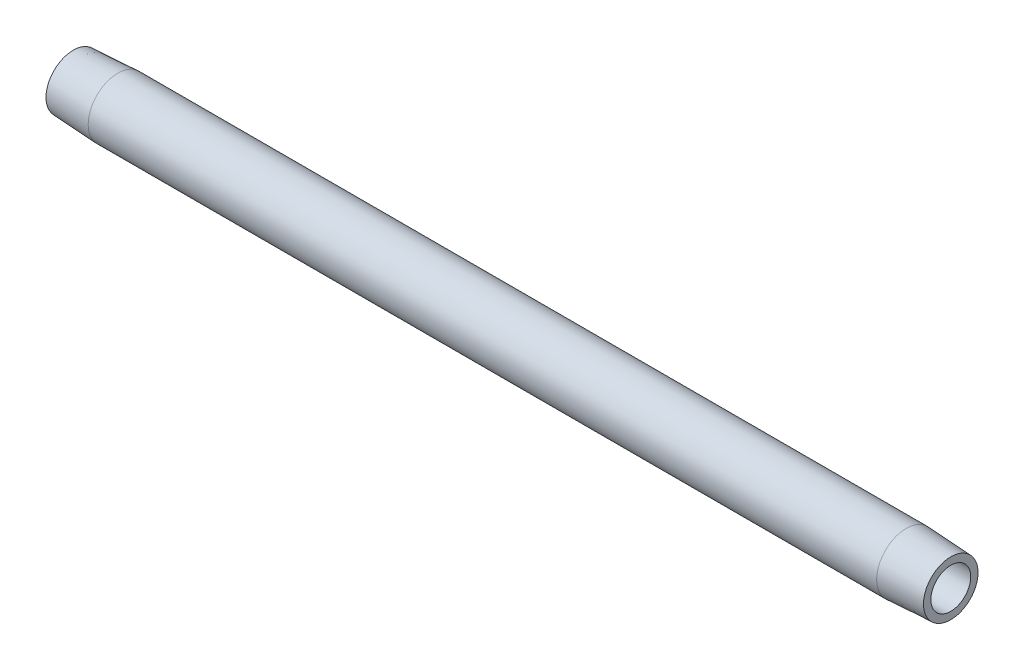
ISO-10303-21;
HEADER;
FILE_DESCRIPTION(('STEP AP214'),'2;1');
FILE_NAME('part.step','',(''),(''),'','','');
FILE_SCHEMA(('AUTOMOTIVE_DESIGN { 1 0 10303 214 1 1 1 1 }'));
ENDSEC;
DATA;
#1=APPLICATION_CONTEXT('core data for automotive mechanical design processes');
#2=APPLICATION_PROTOCOL_DEFINITION('international standard','automotive_design',2000,#1);
#3=PRODUCT_CONTEXT('',#1,'mechanical');
#4=PRODUCT('Part','Part','',(#3));
#5=PRODUCT_RELATED_PRODUCT_CATEGORY('part','',(#4));
#6=PRODUCT_DEFINITION_FORMATION('','',#4);
#7=PRODUCT_DEFINITION_CONTEXT('part definition',#1,'design');
#8=PRODUCT_DEFINITION('design','',#6,#7);
#9=PRODUCT_DEFINITION_SHAPE('','',#8);
#10=(LENGTH_UNIT() NAMED_UNIT(*) SI_UNIT(.MILLI.,.METRE.));
#11=(NAMED_UNIT(*) PLANE_ANGLE_UNIT() SI_UNIT($,.RADIAN.));
#12=(NAMED_UNIT(*) SI_UNIT($,.STERADIAN.) SOLID_ANGLE_UNIT());
#13=UNCERTAINTY_MEASURE_WITH_UNIT(LENGTH_MEASURE(1.E-05),#10,'distance_accuracy_value','');
#14=(GEOMETRIC_REPRESENTATION_CONTEXT(3) GLOBAL_UNCERTAINTY_ASSIGNED_CONTEXT((#13)) GLOBAL_UNIT_ASSIGNED_CONTEXT((#10,
#11,#12)) REPRESENTATION_CONTEXT('',''));
#15=CARTESIAN_POINT('',(0.,0.,0.));
#16=DIRECTION('',(0.,0.,1.));
#17=DIRECTION('',(1.,0.,0.));
#18=AXIS2_PLACEMENT_3D('',#15,#16,#17);
#19=CARTESIAN_POINT('',(203.2,0.,-4.62277681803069));
#20=DIRECTION('',(-1.,0.,0.));
#21=DIRECTION('',(0.,0.,1.));
#22=AXIS2_PLACEMENT_3D('',#19,#20,#21);
#23=PLANE('',#22);
#24=CARTESIAN_POINT('',(203.2,0.,0.));
#25=DIRECTION('',(-1.,0.,0.));
#26=DIRECTION('',(0.,0.,1.));
#27=AXIS2_PLACEMENT_3D('',#24,#25,#26);
#28=CIRCLE('',#27,6.31752683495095);
#29=CARTESIAN_POINT('',(203.2,0.,6.31752683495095));
#30=VERTEX_POINT('',#29);
#31=EDGE_CURVE('E10',#30,#30,#28,.T.);
#32=ORIENTED_EDGE('',*,*,#31,.F.);
#33=EDGE_LOOP('',(#32));
#34=FACE_BOUND('',#33,.T.);
#35=CARTESIAN_POINT('',(203.2,0.,0.));
#36=DIRECTION('',(-1.,0.,0.));
#37=DIRECTION('',(0.,0.,1.));
#38=AXIS2_PLACEMENT_3D('',#35,#36,#37);
#39=CIRCLE('',#38,4.62277681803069);
#40=CARTESIAN_POINT('',(203.2,0.,4.62277681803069));
#41=VERTEX_POINT('',#40);
#42=EDGE_CURVE('E52',#41,#41,#39,.T.);
#43=ORIENTED_EDGE('',*,*,#42,.T.);
#44=EDGE_LOOP('',(#43));
#45=FACE_BOUND('',#44,.T.);
#46=ADVANCED_FACE('F30',(#34,#45),#23,.F.);
#47=CARTESIAN_POINT('',(203.2,0.,0.));
#48=DIRECTION('',(-1.,0.,0.));
#49=DIRECTION('',(0.,0.,1.));
#50=AXIS2_PLACEMENT_3D('',#47,#48,#49);
#51=CONICAL_SURFACE('',#50,6.31752683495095,0.052359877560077);
#52=CARTESIAN_POINT('',(192.887600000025,0.,0.));
#53=DIRECTION('',(-1.,0.,0.));
#54=DIRECTION('',(0.,0.,1.));
#55=AXIS2_PLACEMENT_3D('',#52,#53,#54);
#56=CIRCLE('',#55,6.85797681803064);
#57=CARTESIAN_POINT('',(192.887600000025,0.,6.85797681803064));
#58=VERTEX_POINT('',#57);
#59=EDGE_CURVE('E36',#58,#58,#56,.T.);
#60=ORIENTED_EDGE('',*,*,#59,.F.);
#61=EDGE_LOOP('',(#60));
#62=FACE_BOUND('',#61,.T.);
#63=ORIENTED_EDGE('',*,*,#31,.T.);
#64=EDGE_LOOP('',(#63));
#65=FACE_BOUND('',#64,.T.);
#66=ADVANCED_FACE('F77',(#62,#65),#51,.T.);
#67=CARTESIAN_POINT('',(-6.37599469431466,0.,0.));
#68=DIRECTION('',(-1.,0.,0.));
#69=DIRECTION('',(0.,0.,1.));
#70=AXIS2_PLACEMENT_3D('',#67,#68,#69);
#71=CYLINDRICAL_SURFACE('',#70,6.85797681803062);
#72=CARTESIAN_POINT('',(10.3123999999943,0.,0.));
#73=DIRECTION('',(-1.,0.,0.));
#74=DIRECTION('',(0.,0.,1.));
#75=AXIS2_PLACEMENT_3D('',#72,#73,#74);
#76=CIRCLE('',#75,6.8579768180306);
#77=CARTESIAN_POINT('',(10.3123999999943,0.,6.8579768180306));
#78=VERTEX_POINT('',#77);
#79=EDGE_CURVE('E40',#78,#78,#76,.T.);
#80=ORIENTED_EDGE('',*,*,#79,.F.);
#81=EDGE_LOOP('',(#80));
#82=FACE_BOUND('',#81,.T.);
#83=ORIENTED_EDGE('',*,*,#59,.T.);
#84=EDGE_LOOP('',(#83));
#85=FACE_BOUND('',#84,.T.);
#86=ADVANCED_FACE('F72',(#82,#85),#71,.T.);
#87=CARTESIAN_POINT('',(10.3123999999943,0.,0.));
#88=DIRECTION('',(1.,0.,0.));
#89=DIRECTION('',(0.,0.,-1.));
#90=AXIS2_PLACEMENT_3D('',#87,#88,#89);
#91=CONICAL_SURFACE('',#90,6.8579768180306,0.0523598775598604);
#92=CARTESIAN_POINT('',(1.90819582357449E-11,0.,0.));
#93=DIRECTION('',(-1.,0.,0.));
#94=DIRECTION('',(0.,0.,1.));
#95=AXIS2_PLACEMENT_3D('',#92,#93,#94);
#96=CIRCLE('',#95,6.31752683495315);
#97=CARTESIAN_POINT('',(1.90819582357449E-11,0.,6.31752683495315));
#98=VERTEX_POINT('',#97);
#99=EDGE_CURVE('E44',#98,#98,#96,.T.);
#100=ORIENTED_EDGE('',*,*,#99,.F.);
#101=EDGE_LOOP('',(#100));
#102=FACE_BOUND('',#101,.T.);
#103=ORIENTED_EDGE('',*,*,#79,.T.);
#104=EDGE_LOOP('',(#103));
#105=FACE_BOUND('',#104,.T.);
#106=ADVANCED_FACE('F66',(#102,#105),#91,.T.);
#107=CARTESIAN_POINT('',(1.90819582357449E-11,0.,-6.31752683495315));
#108=DIRECTION('',(1.,0.,0.));
#109=DIRECTION('',(0.,0.,-1.));
#110=AXIS2_PLACEMENT_3D('',#107,#108,#109);
#111=PLANE('',#110);
#112=CARTESIAN_POINT('',(1.90819582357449E-11,0.,0.));
#113=DIRECTION('',(-1.,0.,0.));
#114=DIRECTION('',(0.,0.,1.));
#115=AXIS2_PLACEMENT_3D('',#112,#113,#114);
#116=CIRCLE('',#115,4.62277681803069);
#117=CARTESIAN_POINT('',(1.90819582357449E-11,0.,4.62277681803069));
#118=VERTEX_POINT('',#117);
#119=EDGE_CURVE('E49',#118,#118,#116,.T.);
#120=ORIENTED_EDGE('',*,*,#119,.F.);
#121=EDGE_LOOP('',(#120));
#122=FACE_BOUND('',#121,.T.);
#123=ORIENTED_EDGE('',*,*,#99,.T.);
#124=EDGE_LOOP('',(#123));
#125=FACE_BOUND('',#124,.T.);
#126=ADVANCED_FACE('F60',(#122,#125),#111,.F.);
#127=CARTESIAN_POINT('',(-6.37599469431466,0.,0.));
#128=DIRECTION('',(-1.,0.,0.));
#129=DIRECTION('',(0.,0.,1.));
#130=AXIS2_PLACEMENT_3D('',#127,#128,#129);
#131=CYLINDRICAL_SURFACE('',#130,4.62277681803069);
#132=ORIENTED_EDGE('',*,*,#42,.F.);
#133=EDGE_LOOP('',(#132));
#134=FACE_BOUND('',#133,.T.);
#135=ORIENTED_EDGE('',*,*,#119,.T.);
#136=EDGE_LOOP('',(#135));
#137=FACE_BOUND('',#136,.T.);
#138=ADVANCED_FACE('F57',(#134,#137),#131,.F.);
#139=CLOSED_SHELL('',(#46,#66,#86,#106,#126,#138));
#140=MANIFOLD_SOLID_BREP('B2',#139);
#141=ADVANCED_BREP_SHAPE_REPRESENTATION('',(#18,#140),#14);
#142=SHAPE_DEFINITION_REPRESENTATION(#9,#141);
ENDSEC;
END-ISO-10303-21;
